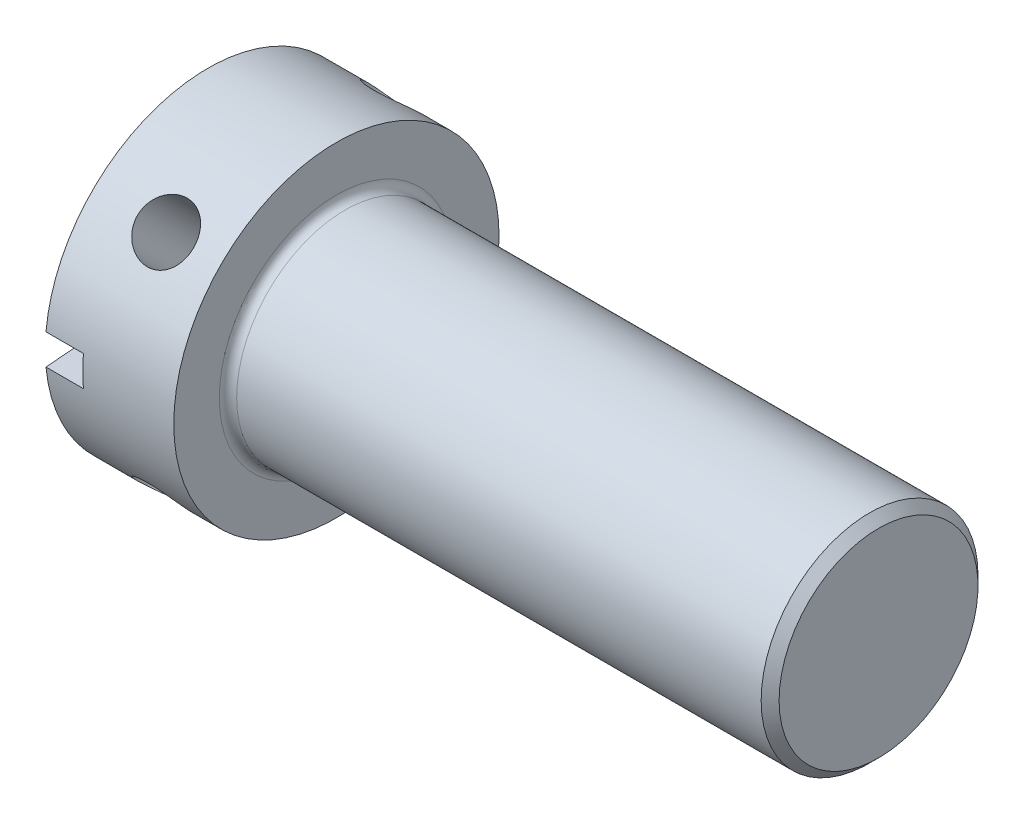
ISO-10303-21;
HEADER;
FILE_DESCRIPTION(('STEP AP214'),'2;1');
FILE_NAME('part.step','',(''),(''),'','','');
FILE_SCHEMA(('AUTOMOTIVE_DESIGN { 1 0 10303 214 1 1 1 1 }'));
ENDSEC;
DATA;
#1=APPLICATION_CONTEXT('core data for automotive mechanical design processes');
#2=APPLICATION_PROTOCOL_DEFINITION('international standard','automotive_design',2000,#1);
#3=PRODUCT_CONTEXT('',#1,'mechanical');
#4=PRODUCT('Part','Part','',(#3));
#5=PRODUCT_RELATED_PRODUCT_CATEGORY('part','',(#4));
#6=PRODUCT_DEFINITION_FORMATION('','',#4);
#7=PRODUCT_DEFINITION_CONTEXT('part definition',#1,'design');
#8=PRODUCT_DEFINITION('design','',#6,#7);
#9=PRODUCT_DEFINITION_SHAPE('','',#8);
#10=(LENGTH_UNIT() NAMED_UNIT(*) SI_UNIT(.MILLI.,.METRE.));
#11=(NAMED_UNIT(*) PLANE_ANGLE_UNIT() SI_UNIT($,.RADIAN.));
#12=(NAMED_UNIT(*) SI_UNIT($,.STERADIAN.) SOLID_ANGLE_UNIT());
#13=UNCERTAINTY_MEASURE_WITH_UNIT(LENGTH_MEASURE(1.E-05),#10,'distance_accuracy_value','');
#14=(GEOMETRIC_REPRESENTATION_CONTEXT(3) GLOBAL_UNCERTAINTY_ASSIGNED_CONTEXT((#13)) GLOBAL_UNIT_ASSIGNED_CONTEXT((#10,
#11,#12)) REPRESENTATION_CONTEXT('',''));
#15=CARTESIAN_POINT('',(0.,0.,0.));
#16=DIRECTION('',(0.,0.,1.));
#17=DIRECTION('',(1.,0.,0.));
#18=AXIS2_PLACEMENT_3D('',#15,#16,#17);
#19=CARTESIAN_POINT('',(7.35,-15.,-15.));
#20=DIRECTION('',(0.,0.707106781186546,0.707106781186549));
#21=DIRECTION('',(0.,-0.707106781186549,0.707106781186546));
#22=AXIS2_PLACEMENT_3D('',#19,#20,#21);
#23=CYLINDRICAL_SURFACE('',#22,2.59);
#24=CARTESIAN_POINT('',(7.35,8.61588734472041,12.2787004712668));
#25=CARTESIAN_POINT('',(7.49431317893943,8.61589328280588,12.2786983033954));
#26=CARTESIAN_POINT('',(7.63870324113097,8.62595636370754,12.271654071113));
#27=CARTESIAN_POINT('',(7.92342648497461,8.66579641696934,12.2435511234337));
#28=CARTESIAN_POINT('',(8.06375588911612,8.69559116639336,12.2224797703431));
#29=CARTESIAN_POINT('',(8.33619628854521,8.77359052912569,12.1666098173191));
#30=CARTESIAN_POINT('',(8.46831425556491,8.82177927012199,12.1318230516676));
#31=CARTESIAN_POINT('',(8.72081834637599,8.93459637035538,12.048977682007));
#32=CARTESIAN_POINT('',(8.84120567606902,8.99922303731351,12.0009204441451));
#33=CARTESIAN_POINT('',(9.06811660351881,9.14311619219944,11.8916626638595));
#34=CARTESIAN_POINT('',(9.17449819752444,9.22251545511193,11.8303420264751));
#35=CARTESIAN_POINT('',(9.36914339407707,9.39260855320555,11.6957532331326));
#36=CARTESIAN_POINT('',(9.45740589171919,9.48330307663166,11.6224843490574));
#37=CARTESIAN_POINT('',(9.61384359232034,9.67339833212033,11.4647586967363));
#38=CARTESIAN_POINT('',(9.68188614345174,9.77285123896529,11.3802330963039));
#39=CARTESIAN_POINT('',(9.79509929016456,9.97653165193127,11.2021023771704));
#40=CARTESIAN_POINT('',(9.84027148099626,10.0807588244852,11.1084978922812));
#41=CARTESIAN_POINT('',(9.9060259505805,10.2894983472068,10.9154124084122));
#42=CARTESIAN_POINT('',(9.92684706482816,10.3939976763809,10.8159987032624));
#43=CARTESIAN_POINT('',(9.94405143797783,10.601060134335,10.6131297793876));
#44=CARTESIAN_POINT('',(9.94043647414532,10.7036234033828,10.5096748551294));
#45=CARTESIAN_POINT('',(9.90905671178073,10.9028056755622,10.3028748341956));
#46=CARTESIAN_POINT('',(9.88154898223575,10.9994762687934,10.1995402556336));
#47=CARTESIAN_POINT('',(9.8035698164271,11.1856044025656,9.99506782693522));
#48=CARTESIAN_POINT('',(9.75309764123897,11.2750617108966,9.89393004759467));
#49=CARTESIAN_POINT('',(9.63036975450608,11.4451986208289,9.69662305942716));
#50=CARTESIAN_POINT('',(9.55800899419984,11.5258332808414,9.60048049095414));
#51=CARTESIAN_POINT('',(9.39363507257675,11.6762862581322,9.41692335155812));
#52=CARTESIAN_POINT('',(9.30162020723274,11.746103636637,9.32950953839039));
#53=CARTESIAN_POINT('',(9.09912673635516,11.874607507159,9.16540888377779));
#54=CARTESIAN_POINT('',(8.98842337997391,11.9331372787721,9.08887648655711));
#55=CARTESIAN_POINT('',(8.75245026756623,12.0370529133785,8.95080150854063));
#56=CARTESIAN_POINT('',(8.62718035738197,12.0824386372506,8.88925908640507));
#57=CARTESIAN_POINT('',(8.36536485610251,12.159496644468,8.78356111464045));
#58=CARTESIAN_POINT('',(8.22880517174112,12.1911514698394,8.73942770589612));
#59=CARTESIAN_POINT('',(7.94843515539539,12.2402395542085,8.67054451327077));
#60=CARTESIAN_POINT('',(7.80462551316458,12.257674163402,8.64579288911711));
#61=CARTESIAN_POINT('',(7.51581072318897,12.2779637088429,8.6169552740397));
#62=CARTESIAN_POINT('',(7.370844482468,12.2810025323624,8.61260864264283));
#63=CARTESIAN_POINT('',(7.08210993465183,12.2729606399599,8.62406425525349));
#64=CARTESIAN_POINT('',(6.93834157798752,12.2618805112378,8.63986566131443));
#65=CARTESIAN_POINT('',(6.65709194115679,12.2258705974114,8.69074442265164));
#66=CARTESIAN_POINT('',(6.51957434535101,12.2010361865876,8.72568901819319));
#67=CARTESIAN_POINT('',(6.2535743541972,12.1379007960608,8.8133003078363));
#68=CARTESIAN_POINT('',(6.12509253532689,12.0995989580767,8.86596813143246));
#69=CARTESIAN_POINT('',(5.87941619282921,12.0095782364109,8.98753503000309));
#70=CARTESIAN_POINT('',(5.76234558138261,11.9577306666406,9.05658916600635));
#71=CARTESIAN_POINT('',(5.54409872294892,11.8415207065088,9.20801140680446));
#72=CARTESIAN_POINT('',(5.44292368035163,11.7771573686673,9.29038051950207));
#73=CARTESIAN_POINT('',(5.25818482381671,11.6361190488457,9.46644459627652));
#74=CARTESIAN_POINT('',(5.17483112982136,11.5593141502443,9.56025616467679));
#75=CARTESIAN_POINT('',(5.02957592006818,11.3953250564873,9.75514025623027));
#76=CARTESIAN_POINT('',(4.96767367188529,11.3081412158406,9.85621253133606));
#77=CARTESIAN_POINT('',(4.86740209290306,11.1256877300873,10.0617020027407));
#78=CARTESIAN_POINT('',(4.82892468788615,11.0304575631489,10.1661014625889));
#79=CARTESIAN_POINT('',(4.77624781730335,10.8339178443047,10.3752979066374));
#80=CARTESIAN_POINT('',(4.76204620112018,10.7326088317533,10.4800948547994));
#81=CARTESIAN_POINT('',(4.75838952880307,10.528067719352,10.6855290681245));
#82=CARTESIAN_POINT('',(4.76861543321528,10.4248776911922,10.7862026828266));
#83=CARTESIAN_POINT('',(4.81283105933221,10.2183678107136,10.98204058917));
#84=CARTESIAN_POINT('',(4.84682062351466,10.11504795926,11.0772049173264));
#85=CARTESIAN_POINT('',(4.93747289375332,9.9116478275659,11.2595687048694));
#86=CARTESIAN_POINT('',(4.99410656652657,9.81156357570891,11.3467781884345));
#87=CARTESIAN_POINT('',(5.1284032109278,9.61774729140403,11.5115218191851));
#88=CARTESIAN_POINT('',(5.2060672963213,9.52401559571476,11.5890554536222));
#89=CARTESIAN_POINT('',(5.381342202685,9.34497366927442,11.7339213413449));
#90=CARTESIAN_POINT('',(5.47918582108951,9.25978072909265,11.8011169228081));
#91=CARTESIAN_POINT('',(5.69155507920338,9.10219656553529,11.9230856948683));
#92=CARTESIAN_POINT('',(5.80608462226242,9.02980834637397,11.977855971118));
#93=CARTESIAN_POINT('',(6.04961875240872,8.90011218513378,12.0745441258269));
#94=CARTESIAN_POINT('',(6.17872747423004,8.8429239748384,12.1163603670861));
#95=CARTESIAN_POINT('',(6.44701071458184,8.74675474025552,12.1859687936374));
#96=CARTESIAN_POINT('',(6.58617517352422,8.70775580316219,12.2137747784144));
#97=CARTESIAN_POINT('',(6.8298724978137,8.65789441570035,12.2491423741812));
#98=CARTESIAN_POINT('',(6.9329424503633,8.64217690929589,12.2602179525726));
#99=CARTESIAN_POINT('',(7.14066147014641,8.62117132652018,12.274997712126));
#100=CARTESIAN_POINT('',(7.24531050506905,8.61588303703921,12.2787020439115));
#101=CARTESIAN_POINT('',(7.35,8.61588734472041,12.2787004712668));
#102=B_SPLINE_CURVE_WITH_KNOTS('',3,(#24,#25,#26,#27,#28,#29,#30,#31,#32,#33,#34,#35,#36,#37,
#38,#39,#40,#41,#42,#43,#44,#45,#46,#47,#48,#49,#50,#51,#52,#53,#54,#55,#56,#57,#58,#59,#60,#61,
#62,#63,#64,#65,#66,#67,#68,#69,#70,#71,#72,#73,#74,#75,#76,#77,#78,#79,#80,#81,#82,#83,#84,#85,
#86,#87,#88,#89,#90,#91,#92,#93,#94,#95,#96,#97,#98,#99,#100,#101),.UNSPECIFIED.,.T.,.F.,(4,2,2,
2,2,2,2,2,2,2,2,2,2,2,2,2,2,2,2,2,2,2,2,2,2,2,2,2,2,2,2,2,2,2,2,2,2,2,4),(0.,0.432556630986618,
0.86550350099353,1.29807761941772,1.73060722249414,2.16723067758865,2.60388075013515,
3.04333521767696,3.4827590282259,3.91783583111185,4.35288099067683,4.78330255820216,
5.21373797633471,5.64627284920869,6.07884523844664,6.51704841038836,6.95525622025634,
7.39401956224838,7.83274123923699,8.2658434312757,8.69892761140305,9.12904565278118,
9.55919111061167,9.9935818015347,10.4280053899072,10.8672985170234,11.3065766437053,
11.7438124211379,12.181009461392,12.6125277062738,13.0440430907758,13.4750069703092,
13.9059936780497,14.342262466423,14.778633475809,15.218346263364,15.6576251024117,
15.9714222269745,16.2852129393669),.UNSPECIFIED.);
#103=CARTESIAN_POINT('',(7.35,8.61588734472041,12.2787004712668));
#104=VERTEX_POINT('',#103);
#105=EDGE_CURVE('E101',#104,#104,#102,.T.);
#106=ORIENTED_EDGE('',*,*,#105,.T.);
#107=EDGE_LOOP('',(#106));
#108=FACE_BOUND('',#107,.T.);
#109=CARTESIAN_POINT('',(7.35,0.,0.));
#110=DIRECTION('',(0.,1.,0.));
#111=DIRECTION('',(0.,0.,1.));
#112=AXIS2_PLACEMENT_3D('',#109,#110,#111);
#113=ELLIPSE('',#112,3.66281312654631,2.59);
#114=CARTESIAN_POINT('',(9.94,0.,0.));
#115=VERTEX_POINT('',#114);
#116=CARTESIAN_POINT('',(4.76,0.,0.));
#117=VERTEX_POINT('',#116);
#118=EDGE_CURVE('E46',#115,#117,#113,.F.);
#119=ORIENTED_EDGE('',*,*,#118,.T.);
#120=CARTESIAN_POINT('',(7.35,0.,0.));
#121=DIRECTION('',(0.,0.,1.));
#122=DIRECTION('',(0.,1.,0.));
#123=AXIS2_PLACEMENT_3D('',#120,#121,#122);
#124=ELLIPSE('',#123,3.66281312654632,2.59);
#125=EDGE_CURVE('E11',#117,#115,#124,.F.);
#126=ORIENTED_EDGE('',*,*,#125,.T.);
#127=EDGE_LOOP('',(#119,#126));
#128=FACE_BOUND('',#127,.T.);
#129=ADVANCED_FACE('F33',(#108,#128),#23,.F.);
#130=CARTESIAN_POINT('',(173.401923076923,0.,0.));
#131=DIRECTION('',(-1.,0.,0.));
#132=DIRECTION('',(0.,-1.,0.));
#133=AXIS2_PLACEMENT_3D('',#130,#131,#132);
#134=SPHERICAL_SURFACE('',#133,173.401923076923);
#135=CARTESIAN_POINT('',(0.649999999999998,0.,0.));
#136=DIRECTION('',(-1.,0.,0.));
#137=DIRECTION('',(0.,0.,1.));
#138=AXIS2_PLACEMENT_3D('',#135,#136,#137);
#139=CIRCLE('',#138,15.);
#140=CARTESIAN_POINT('',(0.650000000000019,1.40500000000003,14.9340542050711));
#141=VERTEX_POINT('',#140);
#142=CARTESIAN_POINT('',(0.649999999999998,1.40500000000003,-14.934054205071));
#143=VERTEX_POINT('',#142);
#144=EDGE_CURVE('E191',#141,#143,#139,.T.);
#145=ORIENTED_EDGE('',*,*,#144,.T.);
#146=CARTESIAN_POINT('',(173.401923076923,1.40500000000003,0.));
#147=DIRECTION('',(0.,-1.,0.));
#148=DIRECTION('',(0.,0.,-1.));
#149=AXIS2_PLACEMENT_3D('',#146,#147,#148);
#150=CIRCLE('',#149,173.396230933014);
#151=EDGE_CURVE('E178',#143,#141,#150,.F.);
#152=ORIENTED_EDGE('',*,*,#151,.T.);
#153=EDGE_LOOP('',(#145,#152));
#154=FACE_BOUND('',#153,.T.);
#155=ADVANCED_FACE('F148',(#154),#134,.T.);
#156=CARTESIAN_POINT('',(0.649999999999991,-1.40500000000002,-14.9340542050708));
#157=VERTEX_POINT('',#156);
#158=CARTESIAN_POINT('',(0.649999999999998,-1.40500000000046,14.934054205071));
#159=VERTEX_POINT('',#158);
#160=EDGE_CURVE('E190',#157,#159,#139,.T.);
#161=ORIENTED_EDGE('',*,*,#160,.T.);
#162=CARTESIAN_POINT('',(173.401923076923,-1.40499999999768,0.));
#163=DIRECTION('',(0.,1.,0.));
#164=DIRECTION('',(-1.,0.,0.));
#165=AXIS2_PLACEMENT_3D('',#162,#163,#164);
#166=CIRCLE('',#165,173.396230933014);
#167=EDGE_CURVE('E54',#159,#157,#166,.F.);
#168=ORIENTED_EDGE('',*,*,#167,.T.);
#169=EDGE_LOOP('',(#161,#168));
#170=FACE_BOUND('',#169,.T.);
#171=ADVANCED_FACE('F143',(#170),#134,.T.);
#172=CARTESIAN_POINT('',(-31.75,0.,0.));
#173=DIRECTION('',(-1.,0.,0.));
#174=DIRECTION('',(0.,0.,1.));
#175=AXIS2_PLACEMENT_3D('',#172,#173,#174);
#176=CYLINDRICAL_SURFACE('',#175,15.);
#177=CARTESIAN_POINT('',(7.35,8.6158873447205,-12.2787004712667));
#178=CARTESIAN_POINT('',(7.20568682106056,8.61589328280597,-12.2786983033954));
#179=CARTESIAN_POINT('',(7.06129675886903,8.62595636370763,-12.271654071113));
#180=CARTESIAN_POINT('',(6.77657351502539,8.66579641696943,-12.2435511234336));
#181=CARTESIAN_POINT('',(6.63624411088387,8.69559116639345,-12.222479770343));
#182=CARTESIAN_POINT('',(6.36380371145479,8.77359052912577,-12.166609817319));
#183=CARTESIAN_POINT('',(6.23168574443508,8.82177927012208,-12.1318230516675));
#184=CARTESIAN_POINT('',(5.97918165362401,8.93459637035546,-12.048977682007));
#185=CARTESIAN_POINT('',(5.85879432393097,8.99922303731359,-12.000920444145));
#186=CARTESIAN_POINT('',(5.63188339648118,9.14311619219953,-11.8916626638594));
#187=CARTESIAN_POINT('',(5.52550180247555,9.22251545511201,-11.830342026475));
#188=CARTESIAN_POINT('',(5.33085660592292,9.39260855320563,-11.6957532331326));
#189=CARTESIAN_POINT('',(5.2425941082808,9.48330307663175,-11.6224843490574));
#190=CARTESIAN_POINT('',(5.08615640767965,9.67339833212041,-11.4647586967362));
#191=CARTESIAN_POINT('',(5.01811385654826,9.77285123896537,-11.3802330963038));
#192=CARTESIAN_POINT('',(4.90490070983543,9.97653165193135,-11.2021023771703));
#193=CARTESIAN_POINT('',(4.85972851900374,10.0807588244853,-11.1084978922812));
#194=CARTESIAN_POINT('',(4.79397404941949,10.2894983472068,-10.9154124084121));
#195=CARTESIAN_POINT('',(4.77315293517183,10.393997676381,-10.8159987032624));
#196=CARTESIAN_POINT('',(4.75594856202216,10.601060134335,-10.6131297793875));
#197=CARTESIAN_POINT('',(4.75956352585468,10.7036234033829,-10.5096748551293));
#198=CARTESIAN_POINT('',(4.79094328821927,10.9028056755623,-10.3028748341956));
#199=CARTESIAN_POINT('',(4.81845101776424,10.9994762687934,-10.1995402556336));
#200=CARTESIAN_POINT('',(4.8964301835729,11.1856044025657,-9.99506782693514));
#201=CARTESIAN_POINT('',(4.94690235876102,11.2750617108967,-9.89393004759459));
#202=CARTESIAN_POINT('',(5.06963024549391,11.4451986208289,-9.69662305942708));
#203=CARTESIAN_POINT('',(5.14199100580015,11.5258332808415,-9.60048049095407));
#204=CARTESIAN_POINT('',(5.30636492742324,11.6762862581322,-9.41692335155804));
#205=CARTESIAN_POINT('',(5.39837979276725,11.746103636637,-9.32950953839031));
#206=CARTESIAN_POINT('',(5.60087326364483,11.874607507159,-9.16540888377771));
#207=CARTESIAN_POINT('',(5.71157662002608,11.9331372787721,-9.08887648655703));
#208=CARTESIAN_POINT('',(5.94754973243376,12.0370529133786,-8.95080150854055));
#209=CARTESIAN_POINT('',(6.07281964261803,12.0824386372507,-8.88925908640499));
#210=CARTESIAN_POINT('',(6.33463514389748,12.159496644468,-8.78356111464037));
#211=CARTESIAN_POINT('',(6.47119482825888,12.1911514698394,-8.73942770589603));
#212=CARTESIAN_POINT('',(6.7515648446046,12.2402395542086,-8.67054451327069));
#213=CARTESIAN_POINT('',(6.89537448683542,12.257674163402,-8.64579288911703));
#214=CARTESIAN_POINT('',(7.18418927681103,12.2779637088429,-8.61695527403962));
#215=CARTESIAN_POINT('',(7.32915551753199,12.2810025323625,-8.61260864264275));
#216=CARTESIAN_POINT('',(7.61789006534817,12.2729606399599,-8.6240642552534));
#217=CARTESIAN_POINT('',(7.76165842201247,12.2618805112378,-8.63986566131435));
#218=CARTESIAN_POINT('',(8.04290805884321,12.2258705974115,-8.69074442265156));
#219=CARTESIAN_POINT('',(8.18042565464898,12.2010361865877,-8.7256890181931));
#220=CARTESIAN_POINT('',(8.44642564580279,12.1379007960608,-8.81330030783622));
#221=CARTESIAN_POINT('',(8.57490746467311,12.0995989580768,-8.86596813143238));
#222=CARTESIAN_POINT('',(8.82058380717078,12.009578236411,-8.98753503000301));
#223=CARTESIAN_POINT('',(8.93765441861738,11.9577306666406,-9.05658916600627));
#224=CARTESIAN_POINT('',(9.15590127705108,11.8415207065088,-9.20801140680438));
#225=CARTESIAN_POINT('',(9.25707631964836,11.7771573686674,-9.29038051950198));
#226=CARTESIAN_POINT('',(9.44181517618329,11.6361190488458,-9.46644459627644));
#227=CARTESIAN_POINT('',(9.52516887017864,11.5593141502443,-9.56025616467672));
#228=CARTESIAN_POINT('',(9.67042407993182,11.3953250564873,-9.7551402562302));
#229=CARTESIAN_POINT('',(9.73232632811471,11.3081412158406,-9.85621253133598));
#230=CARTESIAN_POINT('',(9.83259790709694,11.1256877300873,-10.0617020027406));
#231=CARTESIAN_POINT('',(9.87107531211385,11.030457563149,-10.1661014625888));
#232=CARTESIAN_POINT('',(9.92375218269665,10.8339178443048,-10.3752979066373));
#233=CARTESIAN_POINT('',(9.93795379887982,10.7326088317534,-10.4800948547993));
#234=CARTESIAN_POINT('',(9.94161047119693,10.5280677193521,-10.6855290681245));
#235=CARTESIAN_POINT('',(9.93138456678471,10.4248776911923,-10.7862026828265));
#236=CARTESIAN_POINT('',(9.88716894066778,10.2183678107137,-10.98204058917));
#237=CARTESIAN_POINT('',(9.85317937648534,10.1150479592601,-11.0772049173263));
#238=CARTESIAN_POINT('',(9.76252710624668,9.91164782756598,-11.2595687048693));
#239=CARTESIAN_POINT('',(9.70589343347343,9.81156357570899,-11.3467781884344));
#240=CARTESIAN_POINT('',(9.57159678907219,9.61774729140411,-11.511521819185));
#241=CARTESIAN_POINT('',(9.49393270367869,9.52401559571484,-11.5890554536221));
#242=CARTESIAN_POINT('',(9.318657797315,9.3449736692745,-11.7339213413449));
#243=CARTESIAN_POINT('',(9.22081417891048,9.25978072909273,-11.801116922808));
#244=CARTESIAN_POINT('',(9.00844492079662,9.10219656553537,-11.9230856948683));
#245=CARTESIAN_POINT('',(8.89391537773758,9.02980834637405,-11.977855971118));
#246=CARTESIAN_POINT('',(8.65038124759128,8.90011218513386,-12.0745441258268));
#247=CARTESIAN_POINT('',(8.52127252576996,8.84292397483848,-12.116360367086));
#248=CARTESIAN_POINT('',(8.25298928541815,8.7467547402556,-12.1859687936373));
#249=CARTESIAN_POINT('',(8.11382482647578,8.70775580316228,-12.2137747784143));
#250=CARTESIAN_POINT('',(7.87012750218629,8.65789441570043,-12.2491423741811));
#251=CARTESIAN_POINT('',(7.76705754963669,8.64217690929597,-12.2602179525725));
#252=CARTESIAN_POINT('',(7.55933852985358,8.62117132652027,-12.2749977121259));
#253=CARTESIAN_POINT('',(7.45468949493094,8.61588303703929,-12.2787020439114));
#254=CARTESIAN_POINT('',(7.35,8.6158873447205,-12.2787004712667));
#255=B_SPLINE_CURVE_WITH_KNOTS('',3,(#177,#178,#179,#180,#181,#182,#183,#184,#185,#186,#187,
#188,#189,#190,#191,#192,#193,#194,#195,#196,#197,#198,#199,#200,#201,#202,#203,#204,#205,#206,
#207,#208,#209,#210,#211,#212,#213,#214,#215,#216,#217,#218,#219,#220,#221,#222,#223,#224,#225,
#226,#227,#228,#229,#230,#231,#232,#233,#234,#235,#236,#237,#238,#239,#240,#241,#242,#243,#244,
#245,#246,#247,#248,#249,#250,#251,#252,#253,#254),.UNSPECIFIED.,.T.,.F.,(4,2,2,2,2,2,2,2,2,2,2,
2,2,2,2,2,2,2,2,2,2,2,2,2,2,2,2,2,2,2,2,2,2,2,2,2,2,2,4),(0.,0.432556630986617,
0.865503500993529,1.29807761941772,1.73060722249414,2.16723067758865,2.60388075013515,
3.04333521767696,3.4827590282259,3.91783583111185,4.35288099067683,4.78330255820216,
5.21373797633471,5.64627284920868,6.07884523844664,6.51704841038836,6.95525622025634,
7.39401956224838,7.83274123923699,8.2658434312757,8.69892761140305,9.12904565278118,
9.55919111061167,9.9935818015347,10.4280053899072,10.8672985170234,11.3065766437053,
11.7438124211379,12.181009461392,12.6125277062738,13.0440430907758,13.4750069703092,
13.9059936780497,14.342262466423,14.778633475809,15.218346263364,15.6576251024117,
15.9714222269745,16.2852129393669),.UNSPECIFIED.);
#256=CARTESIAN_POINT('',(7.35,8.6158873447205,-12.2787004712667));
#257=VERTEX_POINT('',#256);
#258=EDGE_CURVE('E157',#257,#257,#255,.T.);
#259=ORIENTED_EDGE('',*,*,#258,.F.);
#260=EDGE_LOOP('',(#259));
#261=FACE_BOUND('',#260,.T.);
#262=CARTESIAN_POINT('',(7.35,-12.2787004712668,8.61588734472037));
#263=CARTESIAN_POINT('',(7.49431317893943,-12.2786983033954,8.61589328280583));
#264=CARTESIAN_POINT('',(7.63870324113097,-12.2716540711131,8.6259563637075));
#265=CARTESIAN_POINT('',(7.9234264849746,-12.2435511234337,8.6657964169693));
#266=CARTESIAN_POINT('',(8.06375588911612,-12.2224797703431,8.69559116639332));
#267=CARTESIAN_POINT('',(8.33619628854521,-12.1666098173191,8.77359052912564));
#268=CARTESIAN_POINT('',(8.46831425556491,-12.1318230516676,8.82177927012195));
#269=CARTESIAN_POINT('',(8.72081834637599,-12.0489776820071,8.93459637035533));
#270=CARTESIAN_POINT('',(8.84120567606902,-12.0009204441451,8.99922303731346));
#271=CARTESIAN_POINT('',(9.06811660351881,-11.8916626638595,9.1431161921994));
#272=CARTESIAN_POINT('',(9.17449819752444,-11.8303420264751,9.22251545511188));
#273=CARTESIAN_POINT('',(9.36914339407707,-11.6957532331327,9.39260855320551));
#274=CARTESIAN_POINT('',(9.45740589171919,-11.6224843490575,9.48330307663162));
#275=CARTESIAN_POINT('',(9.61384359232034,-11.4647586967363,9.67339833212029));
#276=CARTESIAN_POINT('',(9.68188614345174,-11.3802330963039,9.77285123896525));
#277=CARTESIAN_POINT('',(9.79509929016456,-11.2021023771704,9.97653165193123));
#278=CARTESIAN_POINT('',(9.84027148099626,-11.1084978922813,10.0807588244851));
#279=CARTESIAN_POINT('',(9.9060259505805,-10.9154124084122,10.2894983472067));
#280=CARTESIAN_POINT('',(9.92684706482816,-10.8159987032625,10.3939976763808));
#281=CARTESIAN_POINT('',(9.94405143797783,-10.6131297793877,10.6010601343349));
#282=CARTESIAN_POINT('',(9.94043647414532,-10.5096748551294,10.7036234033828));
#283=CARTESIAN_POINT('',(9.90905671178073,-10.3028748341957,10.9028056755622));
#284=CARTESIAN_POINT('',(9.88154898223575,-10.1995402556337,10.9994762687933));
#285=CARTESIAN_POINT('',(9.8035698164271,-9.99506782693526,11.1856044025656));
#286=CARTESIAN_POINT('',(9.75309764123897,-9.89393004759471,11.2750617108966));
#287=CARTESIAN_POINT('',(9.63036975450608,-9.6966230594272,11.4451986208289));
#288=CARTESIAN_POINT('',(9.55800899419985,-9.60048049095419,11.5258332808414));
#289=CARTESIAN_POINT('',(9.39363507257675,-9.41692335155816,11.6762862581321));
#290=CARTESIAN_POINT('',(9.30162020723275,-9.32950953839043,11.7461036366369));
#291=CARTESIAN_POINT('',(9.09912673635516,-9.16540888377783,11.8746075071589));
#292=CARTESIAN_POINT('',(8.98842337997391,-9.08887648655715,11.933137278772));
#293=CARTESIAN_POINT('',(8.75245026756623,-8.95080150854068,12.0370529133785));
#294=CARTESIAN_POINT('',(8.62718035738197,-8.88925908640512,12.0824386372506));
#295=CARTESIAN_POINT('',(8.36536485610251,-8.7835611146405,12.1594966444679));
#296=CARTESIAN_POINT('',(8.22880517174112,-8.73942770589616,12.1911514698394));
#297=CARTESIAN_POINT('',(7.94843515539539,-8.67054451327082,12.2402395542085));
#298=CARTESIAN_POINT('',(7.80462551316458,-8.64579288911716,12.2576741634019));
#299=CARTESIAN_POINT('',(7.51581072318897,-8.61695527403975,12.2779637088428));
#300=CARTESIAN_POINT('',(7.370844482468,-8.61260864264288,12.2810025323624));
#301=CARTESIAN_POINT('',(7.08210993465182,-8.62406425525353,12.2729606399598));
#302=CARTESIAN_POINT('',(6.93834157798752,-8.63986566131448,12.2618805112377));
#303=CARTESIAN_POINT('',(6.65709194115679,-8.69074442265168,12.2258705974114));
#304=CARTESIAN_POINT('',(6.51957434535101,-8.72568901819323,12.2010361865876));
#305=CARTESIAN_POINT('',(6.2535743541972,-8.81330030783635,12.1379007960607));
#306=CARTESIAN_POINT('',(6.12509253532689,-8.86596813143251,12.0995989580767));
#307=CARTESIAN_POINT('',(5.87941619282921,-8.98753503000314,12.0095782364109));
#308=CARTESIAN_POINT('',(5.76234558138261,-9.0565891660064,11.9577306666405));
#309=CARTESIAN_POINT('',(5.54409872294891,-9.20801140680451,11.8415207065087));
#310=CARTESIAN_POINT('',(5.44292368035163,-9.29038051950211,11.7771573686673));
#311=CARTESIAN_POINT('',(5.2581848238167,-9.46644459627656,11.6361190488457));
#312=CARTESIAN_POINT('',(5.17483112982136,-9.56025616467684,11.5593141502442));
#313=CARTESIAN_POINT('',(5.02957592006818,-9.75514025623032,11.3953250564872));
#314=CARTESIAN_POINT('',(4.96767367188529,-9.8562125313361,11.3081412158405));
#315=CARTESIAN_POINT('',(4.86740209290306,-10.0617020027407,11.1256877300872));
#316=CARTESIAN_POINT('',(4.82892468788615,-10.1661014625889,11.0304575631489));
#317=CARTESIAN_POINT('',(4.77624781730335,-10.3752979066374,10.8339178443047));
#318=CARTESIAN_POINT('',(4.76204620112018,-10.4800948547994,10.7326088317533));
#319=CARTESIAN_POINT('',(4.75838952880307,-10.6855290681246,10.528067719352));
#320=CARTESIAN_POINT('',(4.76861543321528,-10.7862026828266,10.4248776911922));
#321=CARTESIAN_POINT('',(4.81283105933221,-10.9820405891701,10.2183678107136));
#322=CARTESIAN_POINT('',(4.84682062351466,-11.0772049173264,10.1150479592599));
#323=CARTESIAN_POINT('',(4.93747289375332,-11.2595687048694,9.91164782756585));
#324=CARTESIAN_POINT('',(4.99410656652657,-11.3467781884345,9.81156357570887));
#325=CARTESIAN_POINT('',(5.1284032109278,-11.5115218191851,9.61774729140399));
#326=CARTESIAN_POINT('',(5.2060672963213,-11.5890554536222,9.52401559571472));
#327=CARTESIAN_POINT('',(5.38134220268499,-11.733921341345,9.34497366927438));
#328=CARTESIAN_POINT('',(5.47918582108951,-11.8011169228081,9.25978072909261));
#329=CARTESIAN_POINT('',(5.69155507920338,-11.9230856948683,9.10219656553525));
#330=CARTESIAN_POINT('',(5.80608462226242,-11.9778559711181,9.02980834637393));
#331=CARTESIAN_POINT('',(6.04961875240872,-12.0745441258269,8.90011218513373));
#332=CARTESIAN_POINT('',(6.17872747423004,-12.1163603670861,8.84292397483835));
#333=CARTESIAN_POINT('',(6.44701071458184,-12.1859687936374,8.74675474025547));
#334=CARTESIAN_POINT('',(6.58617517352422,-12.2137747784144,8.70775580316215));
#335=CARTESIAN_POINT('',(6.82987249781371,-12.2491423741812,8.65789441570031));
#336=CARTESIAN_POINT('',(6.93294245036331,-12.2602179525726,8.64217690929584));
#337=CARTESIAN_POINT('',(7.14066147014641,-12.274997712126,8.62117132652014));
#338=CARTESIAN_POINT('',(7.24531050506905,-12.2787020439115,8.61588303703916));
#339=CARTESIAN_POINT('',(7.35,-12.2787004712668,8.61588734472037));
#340=B_SPLINE_CURVE_WITH_KNOTS('',3,(#262,#263,#264,#265,#266,#267,#268,#269,#270,#271,#272,
#273,#274,#275,#276,#277,#278,#279,#280,#281,#282,#283,#284,#285,#286,#287,#288,#289,#290,#291,
#292,#293,#294,#295,#296,#297,#298,#299,#300,#301,#302,#303,#304,#305,#306,#307,#308,#309,#310,
#311,#312,#313,#314,#315,#316,#317,#318,#319,#320,#321,#322,#323,#324,#325,#326,#327,#328,#329,
#330,#331,#332,#333,#334,#335,#336,#337,#338,#339),.UNSPECIFIED.,.T.,.F.,(4,2,2,2,2,2,2,2,2,2,2,
2,2,2,2,2,2,2,2,2,2,2,2,2,2,2,2,2,2,2,2,2,2,2,2,2,2,2,4),(0.,0.432556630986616,
0.865503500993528,1.29807761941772,1.73060722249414,2.16723067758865,2.60388075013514,
3.04333521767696,3.4827590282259,3.91783583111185,4.35288099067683,4.78330255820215,
5.21373797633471,5.64627284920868,6.07884523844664,6.51704841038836,6.95525622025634,
7.39401956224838,7.83274123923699,8.2658434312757,8.69892761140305,9.12904565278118,
9.55919111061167,9.9935818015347,10.4280053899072,10.8672985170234,11.3065766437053,
11.7438124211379,12.181009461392,12.6125277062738,13.0440430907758,13.4750069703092,
13.9059936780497,14.342262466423,14.778633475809,15.218346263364,15.6576251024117,
15.9714222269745,16.2852129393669),.UNSPECIFIED.);
#341=CARTESIAN_POINT('',(7.35,-12.2787004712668,8.61588734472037));
#342=VERTEX_POINT('',#341);
#343=EDGE_CURVE('E159',#342,#342,#340,.T.);
#344=ORIENTED_EDGE('',*,*,#343,.F.);
#345=EDGE_LOOP('',(#344));
#346=FACE_BOUND('',#345,.T.);
#347=CARTESIAN_POINT('',(7.35,-12.2787004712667,-8.61588734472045));
#348=CARTESIAN_POINT('',(7.20568682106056,-12.2786983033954,-8.61589328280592));
#349=CARTESIAN_POINT('',(7.06129675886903,-12.271654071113,-8.62595636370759));
#350=CARTESIAN_POINT('',(6.77657351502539,-12.2435511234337,-8.66579641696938));
#351=CARTESIAN_POINT('',(6.63624411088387,-12.2224797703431,-8.69559116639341));
#352=CARTESIAN_POINT('',(6.36380371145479,-12.1666098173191,-8.77359052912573));
#353=CARTESIAN_POINT('',(6.23168574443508,-12.1318230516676,-8.82177927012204));
#354=CARTESIAN_POINT('',(5.97918165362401,-12.048977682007,-8.93459637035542));
#355=CARTESIAN_POINT('',(5.85879432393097,-12.000920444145,-8.99922303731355));
#356=CARTESIAN_POINT('',(5.63188339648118,-11.8916626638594,-9.14311619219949));
#357=CARTESIAN_POINT('',(5.52550180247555,-11.8303420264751,-9.22251545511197));
#358=CARTESIAN_POINT('',(5.33085660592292,-11.6957532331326,-9.39260855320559));
#359=CARTESIAN_POINT('',(5.2425941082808,-11.6224843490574,-9.4833030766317));
#360=CARTESIAN_POINT('',(5.08615640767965,-11.4647586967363,-9.67339833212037));
#361=CARTESIAN_POINT('',(5.01811385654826,-11.3802330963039,-9.77285123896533));
#362=CARTESIAN_POINT('',(4.90490070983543,-11.2021023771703,-9.97653165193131));
#363=CARTESIAN_POINT('',(4.85972851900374,-11.1084978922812,-10.0807588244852));
#364=CARTESIAN_POINT('',(4.79397404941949,-10.9154124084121,-10.2894983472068));
#365=CARTESIAN_POINT('',(4.77315293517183,-10.8159987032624,-10.3939976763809));
#366=CARTESIAN_POINT('',(4.75594856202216,-10.6131297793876,-10.601060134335));
#367=CARTESIAN_POINT('',(4.75956352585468,-10.5096748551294,-10.7036234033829));
#368=CARTESIAN_POINT('',(4.79094328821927,-10.3028748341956,-10.9028056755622));
#369=CARTESIAN_POINT('',(4.81845101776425,-10.1995402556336,-10.9994762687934));
#370=CARTESIAN_POINT('',(4.8964301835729,-9.99506782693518,-11.1856044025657));
#371=CARTESIAN_POINT('',(4.94690235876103,-9.89393004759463,-11.2750617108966));
#372=CARTESIAN_POINT('',(5.06963024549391,-9.69662305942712,-11.4451986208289));
#373=CARTESIAN_POINT('',(5.14199100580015,-9.6004804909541,-11.5258332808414));
#374=CARTESIAN_POINT('',(5.30636492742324,-9.41692335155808,-11.6762862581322));
#375=CARTESIAN_POINT('',(5.39837979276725,-9.32950953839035,-11.746103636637));
#376=CARTESIAN_POINT('',(5.60087326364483,-9.16540888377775,-11.874607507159));
#377=CARTESIAN_POINT('',(5.71157662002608,-9.08887648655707,-11.9331372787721));
#378=CARTESIAN_POINT('',(5.94754973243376,-8.95080150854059,-12.0370529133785));
#379=CARTESIAN_POINT('',(6.07281964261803,-8.88925908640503,-12.0824386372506));
#380=CARTESIAN_POINT('',(6.33463514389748,-8.78356111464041,-12.159496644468));
#381=CARTESIAN_POINT('',(6.47119482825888,-8.73942770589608,-12.1911514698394));
#382=CARTESIAN_POINT('',(6.7515648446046,-8.67054451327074,-12.2402395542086));
#383=CARTESIAN_POINT('',(6.89537448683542,-8.64579288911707,-12.257674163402));
#384=CARTESIAN_POINT('',(7.18418927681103,-8.61695527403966,-12.2779637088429));
#385=CARTESIAN_POINT('',(7.32915551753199,-8.61260864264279,-12.2810025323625));
#386=CARTESIAN_POINT('',(7.61789006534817,-8.62406425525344,-12.2729606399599));
#387=CARTESIAN_POINT('',(7.76165842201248,-8.63986566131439,-12.2618805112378));
#388=CARTESIAN_POINT('',(8.04290805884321,-8.6907444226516,-12.2258705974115));
#389=CARTESIAN_POINT('',(8.18042565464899,-8.72568901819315,-12.2010361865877));
#390=CARTESIAN_POINT('',(8.44642564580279,-8.81330030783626,-12.1379007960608));
#391=CARTESIAN_POINT('',(8.57490746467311,-8.86596813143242,-12.0995989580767));
#392=CARTESIAN_POINT('',(8.82058380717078,-8.98753503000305,-12.009578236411));
#393=CARTESIAN_POINT('',(8.93765441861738,-9.05658916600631,-11.9577306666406));
#394=CARTESIAN_POINT('',(9.15590127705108,-9.20801140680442,-11.8415207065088));
#395=CARTESIAN_POINT('',(9.25707631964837,-9.29038051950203,-11.7771573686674));
#396=CARTESIAN_POINT('',(9.44181517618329,-9.46644459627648,-11.6361190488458));
#397=CARTESIAN_POINT('',(9.52516887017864,-9.56025616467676,-11.5593141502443));
#398=CARTESIAN_POINT('',(9.67042407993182,-9.75514025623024,-11.3953250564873));
#399=CARTESIAN_POINT('',(9.73232632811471,-9.85621253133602,-11.3081412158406));
#400=CARTESIAN_POINT('',(9.83259790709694,-10.0617020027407,-11.1256877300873));
#401=CARTESIAN_POINT('',(9.87107531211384,-10.1661014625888,-11.0304575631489));
#402=CARTESIAN_POINT('',(9.92375218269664,-10.3752979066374,-10.8339178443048));
#403=CARTESIAN_POINT('',(9.93795379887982,-10.4800948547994,-10.7326088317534));
#404=CARTESIAN_POINT('',(9.94161047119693,-10.6855290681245,-10.5280677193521));
#405=CARTESIAN_POINT('',(9.93138456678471,-10.7862026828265,-10.4248776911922));
#406=CARTESIAN_POINT('',(9.88716894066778,-10.98204058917,-10.2183678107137));
#407=CARTESIAN_POINT('',(9.85317937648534,-11.0772049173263,-10.11504795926));
#408=CARTESIAN_POINT('',(9.76252710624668,-11.2595687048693,-9.91164782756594));
#409=CARTESIAN_POINT('',(9.70589343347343,-11.3467781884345,-9.81156357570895));
#410=CARTESIAN_POINT('',(9.57159678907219,-11.511521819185,-9.61774729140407));
#411=CARTESIAN_POINT('',(9.49393270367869,-11.5890554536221,-9.52401559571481));
#412=CARTESIAN_POINT('',(9.318657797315,-11.7339213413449,-9.34497366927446));
#413=CARTESIAN_POINT('',(9.22081417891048,-11.8011169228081,-9.25978072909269));
#414=CARTESIAN_POINT('',(9.00844492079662,-11.9230856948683,-9.10219656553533));
#415=CARTESIAN_POINT('',(8.89391537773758,-11.977855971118,-9.02980834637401));
#416=CARTESIAN_POINT('',(8.65038124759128,-12.0745441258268,-8.90011218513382));
#417=CARTESIAN_POINT('',(8.52127252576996,-12.116360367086,-8.84292397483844));
#418=CARTESIAN_POINT('',(8.25298928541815,-12.1859687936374,-8.74675474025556));
#419=CARTESIAN_POINT('',(8.11382482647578,-12.2137747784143,-8.70775580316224));
#420=CARTESIAN_POINT('',(7.87012750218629,-12.2491423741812,-8.65789441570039));
#421=CARTESIAN_POINT('',(7.76705754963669,-12.2602179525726,-8.64217690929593));
#422=CARTESIAN_POINT('',(7.55933852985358,-12.274997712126,-8.62117132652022));
#423=CARTESIAN_POINT('',(7.45468949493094,-12.2787020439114,-8.61588303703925));
#424=CARTESIAN_POINT('',(7.35,-12.2787004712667,-8.61588734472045));
#425=B_SPLINE_CURVE_WITH_KNOTS('',3,(#347,#348,#349,#350,#351,#352,#353,#354,#355,#356,#357,
#358,#359,#360,#361,#362,#363,#364,#365,#366,#367,#368,#369,#370,#371,#372,#373,#374,#375,#376,
#377,#378,#379,#380,#381,#382,#383,#384,#385,#386,#387,#388,#389,#390,#391,#392,#393,#394,#395,
#396,#397,#398,#399,#400,#401,#402,#403,#404,#405,#406,#407,#408,#409,#410,#411,#412,#413,#414,
#415,#416,#417,#418,#419,#420,#421,#422,#423,#424),.UNSPECIFIED.,.T.,.F.,(4,2,2,2,2,2,2,2,2,2,2,
2,2,2,2,2,2,2,2,2,2,2,2,2,2,2,2,2,2,2,2,2,2,2,2,2,2,2,4),(0.,0.432556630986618,
0.865503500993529,1.29807761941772,1.73060722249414,2.16723067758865,2.60388075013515,
3.04333521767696,3.4827590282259,3.91783583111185,4.35288099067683,4.78330255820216,
5.21373797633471,5.64627284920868,6.07884523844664,6.51704841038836,6.95525622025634,
7.39401956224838,7.83274123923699,8.2658434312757,8.69892761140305,9.12904565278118,
9.55919111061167,9.9935818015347,10.4280053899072,10.8672985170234,11.3065766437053,
11.7438124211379,12.181009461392,12.6125277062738,13.0440430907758,13.4750069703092,
13.9059936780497,14.342262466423,14.778633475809,15.218346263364,15.6576251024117,
15.9714222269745,16.2852129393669),.UNSPECIFIED.);
#426=CARTESIAN_POINT('',(7.35,-12.2787004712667,-8.61588734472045));
#427=VERTEX_POINT('',#426);
#428=EDGE_CURVE('E92',#427,#427,#425,.T.);
#429=ORIENTED_EDGE('',*,*,#428,.F.);
#430=EDGE_LOOP('',(#429));
#431=FACE_BOUND('',#430,.T.);
#432=ORIENTED_EDGE('',*,*,#105,.F.);
#433=EDGE_LOOP('',(#432));
#434=FACE_BOUND('',#433,.T.);
#435=CARTESIAN_POINT('',(12.5,0.,0.));
#436=DIRECTION('',(-1.,0.,0.));
#437=DIRECTION('',(0.,0.,1.));
#438=AXIS2_PLACEMENT_3D('',#435,#436,#437);
#439=CIRCLE('',#438,15.);
#440=CARTESIAN_POINT('',(12.5,0.,15.));
#441=VERTEX_POINT('',#440);
#442=EDGE_CURVE('E187',#441,#441,#439,.T.);
#443=ORIENTED_EDGE('',*,*,#442,.T.);
#444=EDGE_LOOP('',(#443));
#445=FACE_BOUND('',#444,.T.);
#446=CARTESIAN_POINT('',(4.10569214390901,0.,0.));
#447=DIRECTION('',(-1.,0.,0.));
#448=DIRECTION('',(0.,0.,1.));
#449=AXIS2_PLACEMENT_3D('',#446,#447,#448);
#450=CIRCLE('',#449,15.);
#451=CARTESIAN_POINT('',(4.10569214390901,-1.40499999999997,-14.934054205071));
#452=VERTEX_POINT('',#451);
#453=CARTESIAN_POINT('',(4.10569214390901,1.40500000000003,-14.934054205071));
#454=VERTEX_POINT('',#453);
#455=EDGE_CURVE('E205',#452,#454,#450,.F.);
#456=ORIENTED_EDGE('',*,*,#455,.T.);
#457=DIRECTION('',(-1.,0.,0.));
#458=VECTOR('',#457,1.);
#459=CARTESIAN_POINT('',(-31.75,1.40500000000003,-14.934054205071));
#460=LINE('',#459,#458);
#461=EDGE_CURVE('E87',#454,#143,#460,.T.);
#462=ORIENTED_EDGE('',*,*,#461,.T.);
#463=ORIENTED_EDGE('',*,*,#144,.F.);
#464=DIRECTION('',(-1.,0.,0.));
#465=VECTOR('',#464,1.);
#466=CARTESIAN_POINT('',(-31.75,1.40500000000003,14.934054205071));
#467=LINE('',#466,#465);
#468=CARTESIAN_POINT('',(4.10569214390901,1.40500000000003,14.934054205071));
#469=VERTEX_POINT('',#468);
#470=EDGE_CURVE('E204',#141,#469,#467,.F.);
#471=ORIENTED_EDGE('',*,*,#470,.T.);
#472=CARTESIAN_POINT('',(4.10569214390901,-1.40499999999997,14.934054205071));
#473=VERTEX_POINT('',#472);
#474=EDGE_CURVE('E201',#469,#473,#450,.F.);
#475=ORIENTED_EDGE('',*,*,#474,.T.);
#476=DIRECTION('',(-1.,0.,0.));
#477=VECTOR('',#476,1.);
#478=CARTESIAN_POINT('',(-31.7499999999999,-1.40500000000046,14.934054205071));
#479=LINE('',#478,#477);
#480=EDGE_CURVE('E199',#473,#159,#479,.T.);
#481=ORIENTED_EDGE('',*,*,#480,.T.);
#482=ORIENTED_EDGE('',*,*,#160,.F.);
#483=DIRECTION('',(-1.,0.,0.));
#484=VECTOR('',#483,1.);
#485=CARTESIAN_POINT('',(-31.7499999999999,-1.40500000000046,-14.934054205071));
#486=LINE('',#485,#484);
#487=EDGE_CURVE('E208',#157,#452,#486,.F.);
#488=ORIENTED_EDGE('',*,*,#487,.T.);
#489=EDGE_LOOP('',(#456,#462,#463,#471,#475,#481,#482,#488));
#490=FACE_BOUND('',#489,.T.);
#491=ADVANCED_FACE('F106',(#261,#346,#431,#434,#445,#490),#176,.T.);
#492=CARTESIAN_POINT('',(12.5,15.,0.));
#493=DIRECTION('',(1.,0.,0.));
#494=DIRECTION('',(0.,0.,-1.));
#495=AXIS2_PLACEMENT_3D('',#492,#493,#494);
#496=PLANE('',#495);
#497=CARTESIAN_POINT('',(12.5,0.,0.));
#498=DIRECTION('',(1.,0.,0.));
#499=DIRECTION('',(0.,0.,-1.));
#500=AXIS2_PLACEMENT_3D('',#497,#498,#499);
#501=CIRCLE('',#500,10.8);
#502=CARTESIAN_POINT('',(12.5,0.,-10.8));
#503=VERTEX_POINT('',#502);
#504=EDGE_CURVE('E194',#503,#503,#501,.F.);
#505=ORIENTED_EDGE('',*,*,#504,.T.);
#506=EDGE_LOOP('',(#505));
#507=FACE_BOUND('',#506,.T.);
#508=ORIENTED_EDGE('',*,*,#442,.F.);
#509=EDGE_LOOP('',(#508));
#510=FACE_BOUND('',#509,.T.);
#511=ADVANCED_FACE('F136',(#507,#510),#496,.T.);
#512=CARTESIAN_POINT('',(-31.75,0.,0.));
#513=DIRECTION('',(-1.,0.,0.));
#514=DIRECTION('',(0.,0.,1.));
#515=AXIS2_PLACEMENT_3D('',#512,#513,#514);
#516=CYLINDRICAL_SURFACE('',#515,10.);
#517=CARTESIAN_POINT('',(13.3,0.,0.));
#518=DIRECTION('',(1.,0.,0.));
#519=DIRECTION('',(0.,0.,-1.));
#520=AXIS2_PLACEMENT_3D('',#517,#518,#519);
#521=CIRCLE('',#520,10.);
#522=CARTESIAN_POINT('',(13.3,0.,-10.));
#523=VERTEX_POINT('',#522);
#524=EDGE_CURVE('E196',#523,#523,#521,.T.);
#525=ORIENTED_EDGE('',*,*,#524,.T.);
#526=EDGE_LOOP('',(#525));
#527=FACE_BOUND('',#526,.T.);
#528=CARTESIAN_POINT('',(61.6719999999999,0.,0.));
#529=DIRECTION('',(-1.,0.,0.));
#530=DIRECTION('',(0.,0.,1.));
#531=AXIS2_PLACEMENT_3D('',#528,#529,#530);
#532=CIRCLE('',#531,10.);
#533=CARTESIAN_POINT('',(61.6719999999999,0.,10.));
#534=VERTEX_POINT('',#533);
#535=EDGE_CURVE('E184',#534,#534,#532,.T.);
#536=ORIENTED_EDGE('',*,*,#535,.T.);
#537=EDGE_LOOP('',(#536));
#538=FACE_BOUND('',#537,.T.);
#539=ADVANCED_FACE('F133',(#527,#538),#516,.T.);
#540=CARTESIAN_POINT('',(62.5,0.,0.));
#541=DIRECTION('',(-1.,0.,0.));
#542=DIRECTION('',(0.,0.,1.));
#543=AXIS2_PLACEMENT_3D('',#540,#541,#542);
#544=CONICAL_SURFACE('',#543,9.172,0.78539816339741);
#545=ORIENTED_EDGE('',*,*,#535,.F.);
#546=EDGE_LOOP('',(#545));
#547=FACE_BOUND('',#546,.T.);
#548=CARTESIAN_POINT('',(62.5,0.,0.));
#549=DIRECTION('',(-1.,0.,0.));
#550=DIRECTION('',(0.,0.,1.));
#551=AXIS2_PLACEMENT_3D('',#548,#549,#550);
#552=CIRCLE('',#551,9.172);
#553=CARTESIAN_POINT('',(62.5,0.,9.172));
#554=VERTEX_POINT('',#553);
#555=EDGE_CURVE('E181',#554,#554,#552,.T.);
#556=ORIENTED_EDGE('',*,*,#555,.T.);
#557=EDGE_LOOP('',(#556));
#558=FACE_BOUND('',#557,.T.);
#559=ADVANCED_FACE('F129',(#547,#558),#544,.T.);
#560=CARTESIAN_POINT('',(62.5,9.172,0.));
#561=DIRECTION('',(1.,0.,0.));
#562=DIRECTION('',(0.,0.,-1.));
#563=AXIS2_PLACEMENT_3D('',#560,#561,#562);
#564=PLANE('',#563);
#565=ORIENTED_EDGE('',*,*,#555,.F.);
#566=EDGE_LOOP('',(#565));
#567=FACE_BOUND('',#566,.T.);
#568=ADVANCED_FACE('F126',(#567),#564,.T.);
#569=CARTESIAN_POINT('',(13.3,0.,0.));
#570=DIRECTION('',(1.,0.,0.));
#571=DIRECTION('',(0.,0.,-1.));
#572=AXIS2_PLACEMENT_3D('',#569,#570,#571);
#573=TOROIDAL_SURFACE('',#572,10.8,0.8);
#574=ORIENTED_EDGE('',*,*,#524,.F.);
#575=EDGE_LOOP('',(#574));
#576=FACE_BOUND('',#575,.T.);
#577=ORIENTED_EDGE('',*,*,#504,.F.);
#578=EDGE_LOOP('',(#577));
#579=FACE_BOUND('',#578,.T.);
#580=ADVANCED_FACE('F35',(#576,#579),#573,.F.);
#581=CARTESIAN_POINT('',(0.00569214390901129,1.40500000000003,113.174655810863));
#582=DIRECTION('',(0.,-1.,0.));
#583=DIRECTION('',(0.,0.,-1.));
#584=AXIS2_PLACEMENT_3D('',#581,#582,#583);
#585=PLANE('',#584);
#586=ORIENTED_EDGE('',*,*,#470,.F.);
#587=ORIENTED_EDGE('',*,*,#151,.F.);
#588=ORIENTED_EDGE('',*,*,#461,.F.);
#589=DIRECTION('',(0.,0.,-1.));
#590=VECTOR('',#589,1.);
#591=CARTESIAN_POINT('',(4.10569214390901,1.40500000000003,113.174655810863));
#592=LINE('',#591,#590);
#593=EDGE_CURVE('E174',#469,#454,#592,.T.);
#594=ORIENTED_EDGE('',*,*,#593,.F.);
#595=EDGE_LOOP('',(#586,#587,#588,#594));
#596=FACE_BOUND('',#595,.T.);
#597=ADVANCED_FACE('F121',(#596),#585,.T.);
#598=CARTESIAN_POINT('',(4.10569214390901,1.40500000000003,113.174655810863));
#599=DIRECTION('',(-1.,0.,0.));
#600=DIRECTION('',(0.,0.,1.));
#601=AXIS2_PLACEMENT_3D('',#598,#599,#600);
#602=PLANE('',#601);
#603=ORIENTED_EDGE('',*,*,#455,.F.);
#604=DIRECTION('',(0.,0.,-1.));
#605=VECTOR('',#604,1.);
#606=CARTESIAN_POINT('',(4.10569214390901,-1.40499999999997,113.174655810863));
#607=LINE('',#606,#605);
#608=EDGE_CURVE('E100',#473,#452,#607,.T.);
#609=ORIENTED_EDGE('',*,*,#608,.F.);
#610=ORIENTED_EDGE('',*,*,#474,.F.);
#611=ORIENTED_EDGE('',*,*,#593,.T.);
#612=EDGE_LOOP('',(#603,#609,#610,#611));
#613=FACE_BOUND('',#612,.T.);
#614=ADVANCED_FACE('F118',(#613),#602,.T.);
#615=CARTESIAN_POINT('',(0.00569214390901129,-1.40500000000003,113.174655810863));
#616=DIRECTION('',(0.,1.,0.));
#617=DIRECTION('',(-1.,0.,0.));
#618=AXIS2_PLACEMENT_3D('',#615,#616,#617);
#619=PLANE('',#618);
#620=ORIENTED_EDGE('',*,*,#487,.F.);
#621=ORIENTED_EDGE('',*,*,#167,.F.);
#622=ORIENTED_EDGE('',*,*,#480,.F.);
#623=ORIENTED_EDGE('',*,*,#608,.T.);
#624=EDGE_LOOP('',(#620,#621,#622,#623));
#625=FACE_BOUND('',#624,.T.);
#626=ADVANCED_FACE('F113',(#625),#619,.T.);
#627=CARTESIAN_POINT('',(7.35,0.,0.));
#628=DIRECTION('',(0.,1.,0.));
#629=DIRECTION('',(0.,0.,1.));
#630=AXIS2_PLACEMENT_3D('',#627,#628,#629);
#631=ELLIPSE('',#630,3.66281312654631,2.59);
#632=EDGE_CURVE('E80',#115,#117,#631,.T.);
#633=ORIENTED_EDGE('',*,*,#632,.T.);
#634=CARTESIAN_POINT('',(7.35,0.,0.));
#635=DIRECTION('',(0.,0.,1.));
#636=DIRECTION('',(0.,1.,0.));
#637=AXIS2_PLACEMENT_3D('',#634,#635,#636);
#638=ELLIPSE('',#637,3.66281312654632,2.59);
#639=EDGE_CURVE('E41',#117,#115,#638,.T.);
#640=ORIENTED_EDGE('',*,*,#639,.T.);
#641=EDGE_LOOP('',(#633,#640));
#642=FACE_BOUND('',#641,.T.);
#643=ORIENTED_EDGE('',*,*,#428,.T.);
#644=EDGE_LOOP('',(#643));
#645=FACE_BOUND('',#644,.T.);
#646=ADVANCED_FACE('F89',(#642,#645),#23,.F.);
#647=CARTESIAN_POINT('',(7.35,15.0000000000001,-14.9999999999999));
#648=DIRECTION('',(0.,-0.707106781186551,0.707106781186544));
#649=DIRECTION('',(0.,-0.707106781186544,-0.707106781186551));
#650=AXIS2_PLACEMENT_3D('',#647,#648,#649);
#651=CYLINDRICAL_SURFACE('',#650,2.59);
#652=ORIENTED_EDGE('',*,*,#343,.T.);
#653=EDGE_LOOP('',(#652));
#654=FACE_BOUND('',#653,.T.);
#655=ORIENTED_EDGE('',*,*,#118,.F.);
#656=ORIENTED_EDGE('',*,*,#639,.F.);
#657=EDGE_LOOP('',(#655,#656));
#658=FACE_BOUND('',#657,.T.);
#659=ADVANCED_FACE('F86',(#654,#658),#651,.F.);
#660=ORIENTED_EDGE('',*,*,#258,.T.);
#661=EDGE_LOOP('',(#660));
#662=FACE_BOUND('',#661,.T.);
#663=ORIENTED_EDGE('',*,*,#632,.F.);
#664=ORIENTED_EDGE('',*,*,#125,.F.);
#665=EDGE_LOOP('',(#663,#664));
#666=FACE_BOUND('',#665,.T.);
#667=ADVANCED_FACE('F81',(#662,#666),#651,.F.);
#668=CLOSED_SHELL('',(#129,#155,#171,#491,#511,#539,#559,#568,#580,#597,#614,#626,#646,#659,#667));
#669=MANIFOLD_SOLID_BREP('B2',#668);
#670=ADVANCED_BREP_SHAPE_REPRESENTATION('',(#18,#669),#14);
#671=SHAPE_DEFINITION_REPRESENTATION(#9,#670);
ENDSEC;
END-ISO-10303-21;
